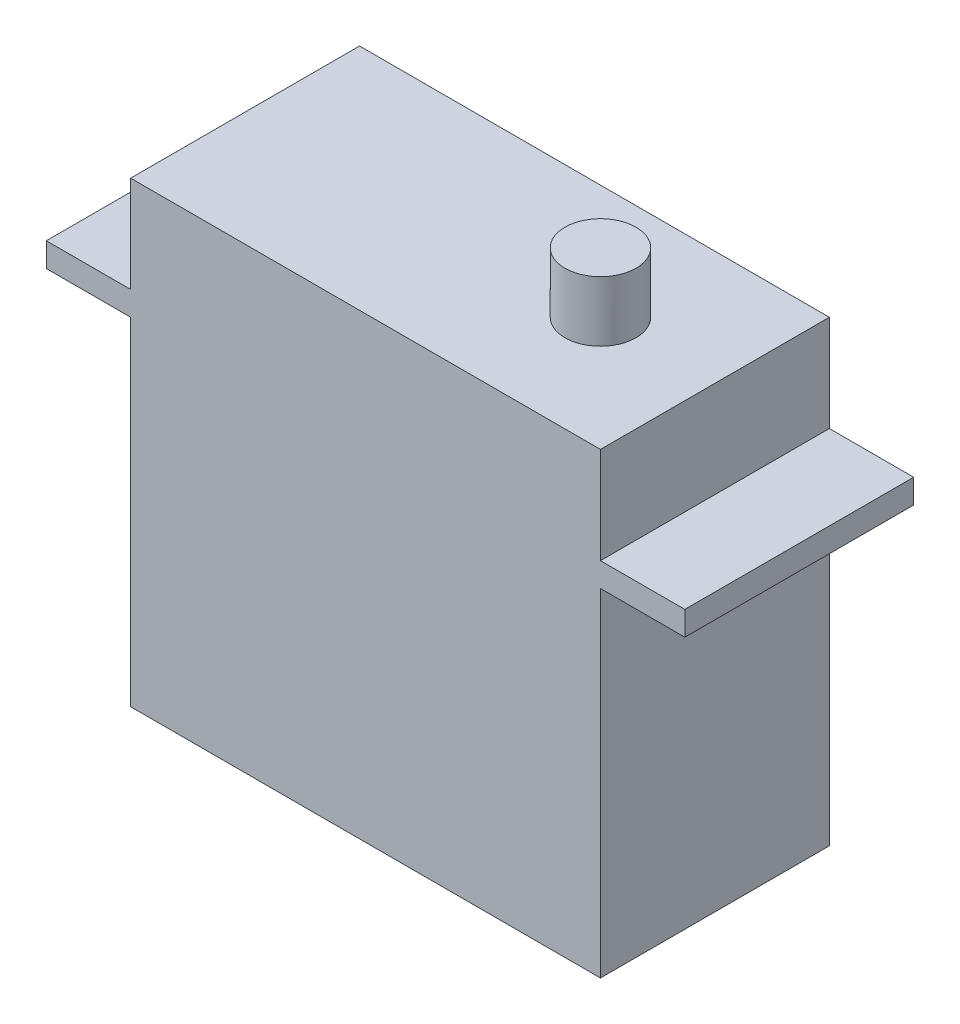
from build123d import *

# Parameters (mm, degrees)
ESQUISSE1_W        = 39
ESQUISSE1_H        = 28
ESQUISSE1_H_2      = 10
ESQUISSE1_W_2      = 7
ESQUISSE1_H_3      = 2
BOSS_EXTRU_1_DEPTH = 19
ESQUISSE2_R        = 2.95
BOSS_EXTRU_2_DEPTH = 5


with BuildPart() as part:
    # Esquisse1 → Boss.-Extru.1 (new body)
    with BuildSketch(Plane.XY):
        with Locations((19.5, 14)):
            Rectangle(ESQUISSE1_W, ESQUISSE1_H)
        with Locations((19.5, 33)):
            Rectangle(ESQUISSE1_W, ESQUISSE1_H_2)
        with Locations((-3.5, 29)):
            Rectangle(ESQUISSE1_W_2, ESQUISSE1_H_3)
        with Locations((42.5, 29)):
            Rectangle(ESQUISSE1_W_2, ESQUISSE1_H_3)
    extrude(amount=BOSS_EXTRU_1_DEPTH)

    # Esquisse2 → Boss.-Extru.2 (add)
    with BuildSketch(Plane(origin=(0, 38, 0), x_dir=(1, 0, 0), z_dir=(0, 1, 0))):
        with Locations(Location((29.5, -9.5, 0), (0, 0, 90))):
            Circle(ESQUISSE2_R)
    extrude(amount=BOSS_EXTRU_2_DEPTH)


solid = part.part
